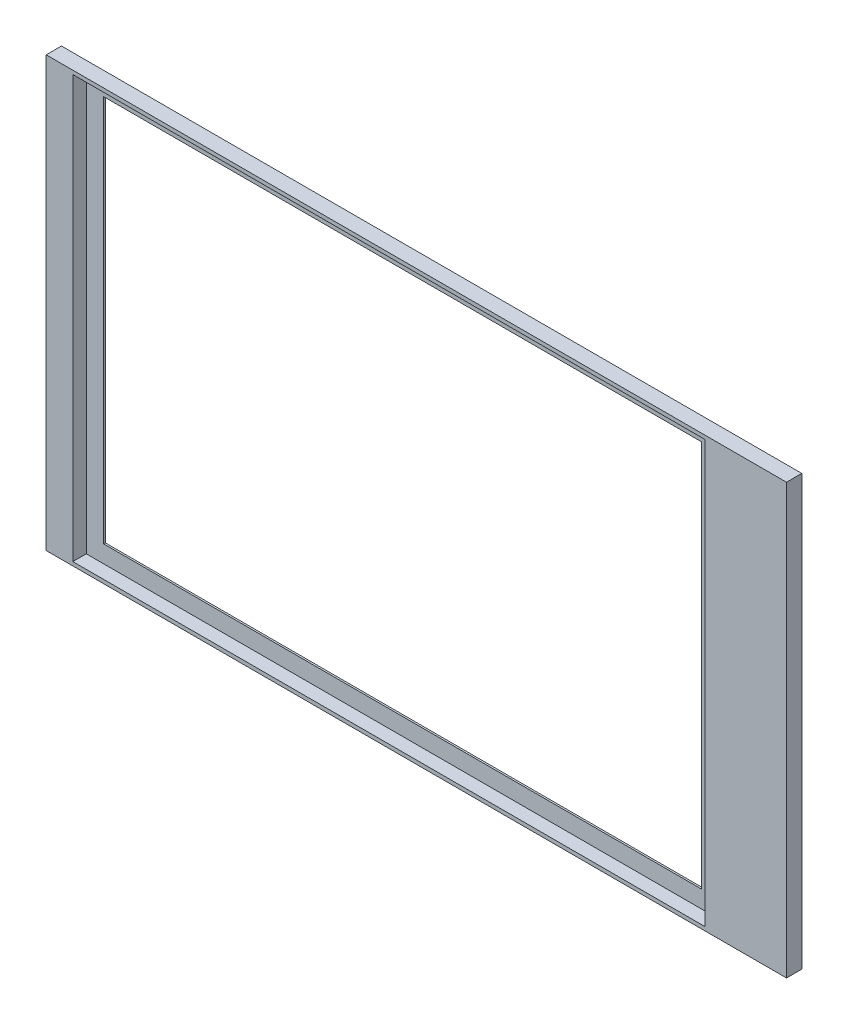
ISO-10303-21;
HEADER;
FILE_DESCRIPTION(('STEP AP214'),'2;1');
FILE_NAME('part.step','',(''),(''),'','','');
FILE_SCHEMA(('AUTOMOTIVE_DESIGN { 1 0 10303 214 1 1 1 1 }'));
ENDSEC;
DATA;
#1=APPLICATION_CONTEXT('core data for automotive mechanical design processes');
#2=APPLICATION_PROTOCOL_DEFINITION('international standard','automotive_design',2000,#1);
#3=PRODUCT_CONTEXT('',#1,'mechanical');
#4=PRODUCT('Part','Part','',(#3));
#5=PRODUCT_RELATED_PRODUCT_CATEGORY('part','',(#4));
#6=PRODUCT_DEFINITION_FORMATION('','',#4);
#7=PRODUCT_DEFINITION_CONTEXT('part definition',#1,'design');
#8=PRODUCT_DEFINITION('design','',#6,#7);
#9=PRODUCT_DEFINITION_SHAPE('','',#8);
#10=(LENGTH_UNIT() NAMED_UNIT(*) SI_UNIT(.MILLI.,.METRE.));
#11=(NAMED_UNIT(*) PLANE_ANGLE_UNIT() SI_UNIT($,.RADIAN.));
#12=(NAMED_UNIT(*) SI_UNIT($,.STERADIAN.) SOLID_ANGLE_UNIT());
#13=UNCERTAINTY_MEASURE_WITH_UNIT(LENGTH_MEASURE(1.E-05),#10,'distance_accuracy_value','');
#14=(GEOMETRIC_REPRESENTATION_CONTEXT(3) GLOBAL_UNCERTAINTY_ASSIGNED_CONTEXT((#13)) GLOBAL_UNIT_ASSIGNED_CONTEXT((#10,
#11,#12)) REPRESENTATION_CONTEXT('',''));
#15=CARTESIAN_POINT('',(0.,0.,0.));
#16=DIRECTION('',(0.,0.,1.));
#17=DIRECTION('',(1.,0.,0.));
#18=AXIS2_PLACEMENT_3D('',#15,#16,#17);
#19=CARTESIAN_POINT('',(0.,723.,23.));
#20=DIRECTION('',(0.,0.,-1.));
#21=DIRECTION('',(-1.,0.,0.));
#22=AXIS2_PLACEMENT_3D('',#19,#20,#21);
#23=PLANE('',#22);
#24=DIRECTION('',(-1.,0.,0.));
#25=VECTOR('',#24,1.);
#26=CARTESIAN_POINT('',(0.,685.,23.));
#27=LINE('',#26,#25);
#28=CARTESIAN_POINT('',(1153.5,685.,23.));
#29=VERTEX_POINT('',#28);
#30=CARTESIAN_POINT('',(38.,685.,23.));
#31=VERTEX_POINT('',#30);
#32=EDGE_CURVE('E138',#29,#31,#27,.T.);
#33=ORIENTED_EDGE('',*,*,#32,.T.);
#34=DIRECTION('',(0.,1.,0.));
#35=VECTOR('',#34,1.);
#36=CARTESIAN_POINT('',(38.,38.,23.));
#37=LINE('',#36,#35);
#38=CARTESIAN_POINT('',(38.,38.,23.));
#39=VERTEX_POINT('',#38);
#40=EDGE_CURVE('E122',#39,#31,#37,.T.);
#41=ORIENTED_EDGE('',*,*,#40,.F.);
#42=DIRECTION('',(-1.,0.,0.));
#43=VECTOR('',#42,1.);
#44=CARTESIAN_POINT('',(1191.5,38.,23.));
#45=LINE('',#44,#43);
#46=CARTESIAN_POINT('',(1153.5,38.,23.));
#47=VERTEX_POINT('',#46);
#48=EDGE_CURVE('E147',#47,#39,#45,.T.);
#49=ORIENTED_EDGE('',*,*,#48,.F.);
#50=DIRECTION('',(0.,-1.,0.));
#51=VECTOR('',#50,1.);
#52=CARTESIAN_POINT('',(1153.5,685.,23.));
#53=LINE('',#52,#51);
#54=EDGE_CURVE('E142',#29,#47,#53,.T.);
#55=ORIENTED_EDGE('',*,*,#54,.F.);
#56=EDGE_LOOP('',(#33,#41,#49,#55));
#57=FACE_BOUND('',#56,.T.);
#58=DIRECTION('',(0.,-1.,0.));
#59=VECTOR('',#58,1.);
#60=CARTESIAN_POINT('',(78.,43.66,23.));
#61=LINE('',#60,#59);
#62=CARTESIAN_POINT('',(78.,679.34,23.));
#63=VERTEX_POINT('',#62);
#64=CARTESIAN_POINT('',(78.,43.66,23.));
#65=VERTEX_POINT('',#64);
#66=EDGE_CURVE('E256',#63,#65,#61,.T.);
#67=ORIENTED_EDGE('',*,*,#66,.F.);
#68=DIRECTION('',(-1.,0.,0.));
#69=VECTOR('',#68,1.);
#70=CARTESIAN_POINT('',(78.,679.34,23.));
#71=LINE('',#70,#69);
#72=CARTESIAN_POINT('',(1031.,679.34,23.));
#73=VERTEX_POINT('',#72);
#74=EDGE_CURVE('E240',#73,#63,#71,.T.);
#75=ORIENTED_EDGE('',*,*,#74,.F.);
#76=DIRECTION('',(0.,1.,0.));
#77=VECTOR('',#76,1.);
#78=CARTESIAN_POINT('',(1031.,43.66,23.));
#79=LINE('',#78,#77);
#80=CARTESIAN_POINT('',(1031.,43.66,23.));
#81=VERTEX_POINT('',#80);
#82=EDGE_CURVE('E245',#81,#73,#79,.T.);
#83=ORIENTED_EDGE('',*,*,#82,.F.);
#84=DIRECTION('',(1.,0.,0.));
#85=VECTOR('',#84,1.);
#86=CARTESIAN_POINT('',(78.,43.66,23.));
#87=LINE('',#86,#85);
#88=EDGE_CURVE('E259',#65,#81,#87,.T.);
#89=ORIENTED_EDGE('',*,*,#88,.F.);
#90=EDGE_LOOP('',(#67,#75,#83,#89));
#91=FACE_BOUND('',#90,.T.);
#92=ADVANCED_FACE('F31',(#57,#91),#23,.F.);
#93=CARTESIAN_POINT('',(0.,723.,0.));
#94=DIRECTION('',(0.,0.,-1.));
#95=DIRECTION('',(-1.,0.,0.));
#96=AXIS2_PLACEMENT_3D('',#93,#94,#95);
#97=PLANE('',#96);
#98=DIRECTION('',(0.,1.,0.));
#99=VECTOR('',#98,1.);
#100=CARTESIAN_POINT('',(38.,38.,0.));
#101=LINE('',#100,#99);
#102=CARTESIAN_POINT('',(38.0000000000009,38.,0.));
#103=VERTEX_POINT('',#102);
#104=CARTESIAN_POINT('',(38.0000000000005,685.,0.));
#105=VERTEX_POINT('',#104);
#106=EDGE_CURVE('E46',#103,#105,#101,.T.);
#107=ORIENTED_EDGE('',*,*,#106,.T.);
#108=DIRECTION('',(-1.,0.,0.));
#109=VECTOR('',#108,1.);
#110=CARTESIAN_POINT('',(1191.5,685.,0.));
#111=LINE('',#110,#109);
#112=CARTESIAN_POINT('',(1153.5,685.,0.));
#113=VERTEX_POINT('',#112);
#114=EDGE_CURVE('E11',#113,#105,#111,.T.);
#115=ORIENTED_EDGE('',*,*,#114,.F.);
#116=DIRECTION('',(0.,1.,0.));
#117=VECTOR('',#116,1.);
#118=CARTESIAN_POINT('',(1153.5,685.,0.));
#119=LINE('',#118,#117);
#120=CARTESIAN_POINT('',(1153.5,38.,0.));
#121=VERTEX_POINT('',#120);
#122=EDGE_CURVE('E143',#121,#113,#119,.T.);
#123=ORIENTED_EDGE('',*,*,#122,.F.);
#124=DIRECTION('',(1.,0.,0.));
#125=VECTOR('',#124,1.);
#126=CARTESIAN_POINT('',(1191.5,38.,0.));
#127=LINE('',#126,#125);
#128=EDGE_CURVE('E39',#103,#121,#127,.T.);
#129=ORIENTED_EDGE('',*,*,#128,.F.);
#130=EDGE_LOOP('',(#107,#115,#123,#129));
#131=FACE_BOUND('',#130,.T.);
#132=DIRECTION('',(0.,-1.,0.));
#133=VECTOR('',#132,1.);
#134=CARTESIAN_POINT('',(104.,653.34,0.));
#135=LINE('',#134,#133);
#136=CARTESIAN_POINT('',(104.,653.34,0.));
#137=VERTEX_POINT('',#136);
#138=CARTESIAN_POINT('',(104.,69.66,0.));
#139=VERTEX_POINT('',#138);
#140=EDGE_CURVE('E216',#137,#139,#135,.T.);
#141=ORIENTED_EDGE('',*,*,#140,.T.);
#142=DIRECTION('',(1.,0.,0.));
#143=VECTOR('',#142,1.);
#144=CARTESIAN_POINT('',(104.,69.66,0.));
#145=LINE('',#144,#143);
#146=CARTESIAN_POINT('',(1005.,69.6599999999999,0.));
#147=VERTEX_POINT('',#146);
#148=EDGE_CURVE('E232',#139,#147,#145,.T.);
#149=ORIENTED_EDGE('',*,*,#148,.T.);
#150=DIRECTION('',(0.,1.,0.));
#151=VECTOR('',#150,1.);
#152=CARTESIAN_POINT('',(1005.,653.34,0.));
#153=LINE('',#152,#151);
#154=CARTESIAN_POINT('',(1005.,653.34,0.));
#155=VERTEX_POINT('',#154);
#156=EDGE_CURVE('E210',#147,#155,#153,.T.);
#157=ORIENTED_EDGE('',*,*,#156,.T.);
#158=DIRECTION('',(-1.,0.,0.));
#159=VECTOR('',#158,1.);
#160=CARTESIAN_POINT('',(104.,653.34,0.));
#161=LINE('',#160,#159);
#162=EDGE_CURVE('E213',#155,#137,#161,.T.);
#163=ORIENTED_EDGE('',*,*,#162,.T.);
#164=EDGE_LOOP('',(#141,#149,#157,#163));
#165=FACE_BOUND('',#164,.T.);
#166=ADVANCED_FACE('F33',(#131,#165),#97,.T.);
#167=CARTESIAN_POINT('',(1191.5,685.,20.34));
#168=DIRECTION('',(0.,-1.,0.));
#169=DIRECTION('',(0.,0.,-1.));
#170=AXIS2_PLACEMENT_3D('',#167,#168,#169);
#171=PLANE('',#170);
#172=ORIENTED_EDGE('',*,*,#114,.T.);
#173=DIRECTION('',(0.,0.,1.));
#174=VECTOR('',#173,1.);
#175=CARTESIAN_POINT('',(38.,685.,-0.001000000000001));
#176=LINE('',#175,#174);
#177=EDGE_CURVE('E118',#105,#31,#176,.T.);
#178=ORIENTED_EDGE('',*,*,#177,.T.);
#179=ORIENTED_EDGE('',*,*,#32,.F.);
#180=DIRECTION('',(0.,0.,1.));
#181=VECTOR('',#180,1.);
#182=CARTESIAN_POINT('',(1153.5,685.,0.));
#183=LINE('',#182,#181);
#184=EDGE_CURVE('E137',#113,#29,#183,.T.);
#185=ORIENTED_EDGE('',*,*,#184,.F.);
#186=EDGE_LOOP('',(#172,#178,#179,#185));
#187=FACE_BOUND('',#186,.T.);
#188=ADVANCED_FACE('F136',(#187),#171,.F.);
#189=CARTESIAN_POINT('',(1191.5,38.,20.34));
#190=DIRECTION('',(0.,1.,0.));
#191=DIRECTION('',(0.,0.,1.));
#192=AXIS2_PLACEMENT_3D('',#189,#190,#191);
#193=PLANE('',#192);
#194=ORIENTED_EDGE('',*,*,#48,.T.);
#195=DIRECTION('',(0.,0.,1.));
#196=VECTOR('',#195,1.);
#197=CARTESIAN_POINT('',(38.,38.,-0.001000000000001));
#198=LINE('',#197,#196);
#199=EDGE_CURVE('E127',#103,#39,#198,.T.);
#200=ORIENTED_EDGE('',*,*,#199,.F.);
#201=ORIENTED_EDGE('',*,*,#128,.T.);
#202=DIRECTION('',(0.,0.,-1.));
#203=VECTOR('',#202,1.);
#204=CARTESIAN_POINT('',(1153.5,38.,0.));
#205=LINE('',#204,#203);
#206=EDGE_CURVE('E145',#47,#121,#205,.T.);
#207=ORIENTED_EDGE('',*,*,#206,.F.);
#208=EDGE_LOOP('',(#194,#200,#201,#207));
#209=FACE_BOUND('',#208,.T.);
#210=ADVANCED_FACE('F273',(#209),#193,.F.);
#211=CARTESIAN_POINT('',(78.,679.34,2.66));
#212=DIRECTION('',(0.,1.,0.));
#213=DIRECTION('',(0.,0.,1.));
#214=AXIS2_PLACEMENT_3D('',#211,#212,#213);
#215=PLANE('',#214);
#216=ORIENTED_EDGE('',*,*,#74,.T.);
#217=DIRECTION('',(0.,0.,1.));
#218=VECTOR('',#217,1.);
#219=CARTESIAN_POINT('',(78.,679.34,2.66));
#220=LINE('',#219,#218);
#221=CARTESIAN_POINT('',(78.,679.34,2.66));
#222=VERTEX_POINT('',#221);
#223=EDGE_CURVE('E254',#222,#63,#220,.T.);
#224=ORIENTED_EDGE('',*,*,#223,.F.);
#225=DIRECTION('',(-1.,0.,0.));
#226=VECTOR('',#225,1.);
#227=CARTESIAN_POINT('',(78.,679.34,2.66));
#228=LINE('',#227,#226);
#229=CARTESIAN_POINT('',(1031.,679.34,2.66));
#230=VERTEX_POINT('',#229);
#231=EDGE_CURVE('E241',#230,#222,#228,.T.);
#232=ORIENTED_EDGE('',*,*,#231,.F.);
#233=DIRECTION('',(0.,0.,1.));
#234=VECTOR('',#233,1.);
#235=CARTESIAN_POINT('',(1031.,679.34,2.66));
#236=LINE('',#235,#234);
#237=EDGE_CURVE('E264',#230,#73,#236,.T.);
#238=ORIENTED_EDGE('',*,*,#237,.T.);
#239=EDGE_LOOP('',(#216,#224,#232,#238));
#240=FACE_BOUND('',#239,.T.);
#241=ADVANCED_FACE('F366',(#240),#215,.F.);
#242=CARTESIAN_POINT('',(1031.,43.66,2.66));
#243=DIRECTION('',(1.,0.,0.));
#244=DIRECTION('',(0.,0.,-1.));
#245=AXIS2_PLACEMENT_3D('',#242,#243,#244);
#246=PLANE('',#245);
#247=ORIENTED_EDGE('',*,*,#82,.T.);
#248=ORIENTED_EDGE('',*,*,#237,.F.);
#249=DIRECTION('',(0.,1.,0.));
#250=VECTOR('',#249,1.);
#251=CARTESIAN_POINT('',(1031.,43.66,2.66));
#252=LINE('',#251,#250);
#253=CARTESIAN_POINT('',(1031.,43.66,2.66));
#254=VERTEX_POINT('',#253);
#255=EDGE_CURVE('E251',#254,#230,#252,.T.);
#256=ORIENTED_EDGE('',*,*,#255,.F.);
#257=DIRECTION('',(0.,0.,1.));
#258=VECTOR('',#257,1.);
#259=CARTESIAN_POINT('',(1031.,43.66,2.66));
#260=LINE('',#259,#258);
#261=EDGE_CURVE('E266',#254,#81,#260,.T.);
#262=ORIENTED_EDGE('',*,*,#261,.T.);
#263=EDGE_LOOP('',(#247,#248,#256,#262));
#264=FACE_BOUND('',#263,.T.);
#265=ADVANCED_FACE('F369',(#264),#246,.F.);
#266=CARTESIAN_POINT('',(78.,43.66,2.66));
#267=DIRECTION('',(0.,-1.,0.));
#268=DIRECTION('',(1.,0.,0.));
#269=AXIS2_PLACEMENT_3D('',#266,#267,#268);
#270=PLANE('',#269);
#271=ORIENTED_EDGE('',*,*,#88,.T.);
#272=ORIENTED_EDGE('',*,*,#261,.F.);
#273=DIRECTION('',(1.,0.,0.));
#274=VECTOR('',#273,1.);
#275=CARTESIAN_POINT('',(78.,43.66,2.66));
#276=LINE('',#275,#274);
#277=CARTESIAN_POINT('',(78.,43.66,2.66));
#278=VERTEX_POINT('',#277);
#279=EDGE_CURVE('E248',#278,#254,#276,.T.);
#280=ORIENTED_EDGE('',*,*,#279,.F.);
#281=DIRECTION('',(0.,0.,1.));
#282=VECTOR('',#281,1.);
#283=CARTESIAN_POINT('',(78.,43.66,2.66));
#284=LINE('',#283,#282);
#285=EDGE_CURVE('E268',#278,#65,#284,.T.);
#286=ORIENTED_EDGE('',*,*,#285,.T.);
#287=EDGE_LOOP('',(#271,#272,#280,#286));
#288=FACE_BOUND('',#287,.T.);
#289=ADVANCED_FACE('F375',(#288),#270,.F.);
#290=CARTESIAN_POINT('',(78.,43.66,2.66));
#291=DIRECTION('',(-1.,0.,0.));
#292=DIRECTION('',(0.,-1.,0.));
#293=AXIS2_PLACEMENT_3D('',#290,#291,#292);
#294=PLANE('',#293);
#295=ORIENTED_EDGE('',*,*,#66,.T.);
#296=ORIENTED_EDGE('',*,*,#285,.F.);
#297=DIRECTION('',(0.,-1.,0.));
#298=VECTOR('',#297,1.);
#299=CARTESIAN_POINT('',(78.,43.66,2.66));
#300=LINE('',#299,#298);
#301=EDGE_CURVE('E244',#222,#278,#300,.T.);
#302=ORIENTED_EDGE('',*,*,#301,.F.);
#303=ORIENTED_EDGE('',*,*,#223,.T.);
#304=EDGE_LOOP('',(#295,#296,#302,#303));
#305=FACE_BOUND('',#304,.T.);
#306=ADVANCED_FACE('F371',(#305),#294,.F.);
#307=CARTESIAN_POINT('',(1031.,679.34,2.66));
#308=DIRECTION('',(0.,0.,1.));
#309=DIRECTION('',(1.,0.,0.));
#310=AXIS2_PLACEMENT_3D('',#307,#308,#309);
#311=PLANE('',#310);
#312=DIRECTION('',(0.,-1.,0.));
#313=VECTOR('',#312,1.);
#314=CARTESIAN_POINT('',(104.,653.34,2.66));
#315=LINE('',#314,#313);
#316=CARTESIAN_POINT('',(104.,653.34,2.66));
#317=VERTEX_POINT('',#316);
#318=CARTESIAN_POINT('',(104.,69.6599999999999,2.66));
#319=VERTEX_POINT('',#318);
#320=EDGE_CURVE('E219',#317,#319,#315,.T.);
#321=ORIENTED_EDGE('',*,*,#320,.F.);
#322=DIRECTION('',(-1.,0.,0.));
#323=VECTOR('',#322,1.);
#324=CARTESIAN_POINT('',(104.,653.34,2.66));
#325=LINE('',#324,#323);
#326=CARTESIAN_POINT('',(1005.,653.34,2.66));
#327=VERTEX_POINT('',#326);
#328=EDGE_CURVE('E226',#327,#317,#325,.T.);
#329=ORIENTED_EDGE('',*,*,#328,.F.);
#330=DIRECTION('',(0.,1.,0.));
#331=VECTOR('',#330,1.);
#332=CARTESIAN_POINT('',(1005.,653.34,2.66));
#333=LINE('',#332,#331);
#334=CARTESIAN_POINT('',(1005.,69.66,2.66));
#335=VERTEX_POINT('',#334);
#336=EDGE_CURVE('E223',#335,#327,#333,.T.);
#337=ORIENTED_EDGE('',*,*,#336,.F.);
#338=DIRECTION('',(1.,0.,0.));
#339=VECTOR('',#338,1.);
#340=CARTESIAN_POINT('',(104.,69.66,2.66));
#341=LINE('',#340,#339);
#342=EDGE_CURVE('E221',#319,#335,#341,.T.);
#343=ORIENTED_EDGE('',*,*,#342,.F.);
#344=EDGE_LOOP('',(#321,#329,#337,#343));
#345=FACE_BOUND('',#344,.T.);
#346=ORIENTED_EDGE('',*,*,#231,.T.);
#347=ORIENTED_EDGE('',*,*,#301,.T.);
#348=ORIENTED_EDGE('',*,*,#279,.T.);
#349=ORIENTED_EDGE('',*,*,#255,.T.);
#350=EDGE_LOOP('',(#346,#347,#348,#349));
#351=FACE_BOUND('',#350,.T.);
#352=ADVANCED_FACE('F374',(#345,#351),#311,.T.);
#353=CARTESIAN_POINT('',(104.,653.34,-0.00100000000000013));
#354=DIRECTION('',(-1.,0.,0.));
#355=DIRECTION('',(0.,0.,1.));
#356=AXIS2_PLACEMENT_3D('',#353,#354,#355);
#357=PLANE('',#356);
#358=DIRECTION('',(0.,0.,1.));
#359=VECTOR('',#358,1.);
#360=CARTESIAN_POINT('',(104.,653.34,-0.00100000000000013));
#361=LINE('',#360,#359);
#362=EDGE_CURVE('E230',#137,#317,#361,.T.);
#363=ORIENTED_EDGE('',*,*,#362,.T.);
#364=ORIENTED_EDGE('',*,*,#320,.T.);
#365=DIRECTION('',(0.,0.,1.));
#366=VECTOR('',#365,1.);
#367=CARTESIAN_POINT('',(104.,69.66,-0.00100000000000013));
#368=LINE('',#367,#366);
#369=EDGE_CURVE('E229',#139,#319,#368,.T.);
#370=ORIENTED_EDGE('',*,*,#369,.F.);
#371=ORIENTED_EDGE('',*,*,#140,.F.);
#372=EDGE_LOOP('',(#363,#364,#370,#371));
#373=FACE_BOUND('',#372,.T.);
#374=ADVANCED_FACE('F385',(#373),#357,.F.);
#375=CARTESIAN_POINT('',(104.,653.34,-0.00100000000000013));
#376=DIRECTION('',(0.,1.,0.));
#377=DIRECTION('',(0.,0.,1.));
#378=AXIS2_PLACEMENT_3D('',#375,#376,#377);
#379=PLANE('',#378);
#380=DIRECTION('',(0.,0.,1.));
#381=VECTOR('',#380,1.);
#382=CARTESIAN_POINT('',(1005.,653.34,-0.00100000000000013));
#383=LINE('',#382,#381);
#384=EDGE_CURVE('E233',#155,#327,#383,.T.);
#385=ORIENTED_EDGE('',*,*,#384,.T.);
#386=ORIENTED_EDGE('',*,*,#328,.T.);
#387=ORIENTED_EDGE('',*,*,#362,.F.);
#388=ORIENTED_EDGE('',*,*,#162,.F.);
#389=EDGE_LOOP('',(#385,#386,#387,#388));
#390=FACE_BOUND('',#389,.T.);
#391=ADVANCED_FACE('F389',(#390),#379,.F.);
#392=CARTESIAN_POINT('',(1005.,653.34,-0.00100000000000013));
#393=DIRECTION('',(1.,0.,0.));
#394=DIRECTION('',(0.,0.,-1.));
#395=AXIS2_PLACEMENT_3D('',#392,#393,#394);
#396=PLANE('',#395);
#397=DIRECTION('',(0.,0.,1.));
#398=VECTOR('',#397,1.);
#399=CARTESIAN_POINT('',(1005.,69.66,-0.00100000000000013));
#400=LINE('',#399,#398);
#401=EDGE_CURVE('E54',#147,#335,#400,.T.);
#402=ORIENTED_EDGE('',*,*,#401,.T.);
#403=ORIENTED_EDGE('',*,*,#336,.T.);
#404=ORIENTED_EDGE('',*,*,#384,.F.);
#405=ORIENTED_EDGE('',*,*,#156,.F.);
#406=EDGE_LOOP('',(#402,#403,#404,#405));
#407=FACE_BOUND('',#406,.T.);
#408=ADVANCED_FACE('F394',(#407),#396,.F.);
#409=CARTESIAN_POINT('',(104.,69.66,-0.00100000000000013));
#410=DIRECTION('',(0.,-1.,0.));
#411=DIRECTION('',(0.,0.,-1.));
#412=AXIS2_PLACEMENT_3D('',#409,#410,#411);
#413=PLANE('',#412);
#414=ORIENTED_EDGE('',*,*,#369,.T.);
#415=ORIENTED_EDGE('',*,*,#342,.T.);
#416=ORIENTED_EDGE('',*,*,#401,.F.);
#417=ORIENTED_EDGE('',*,*,#148,.F.);
#418=EDGE_LOOP('',(#414,#415,#416,#417));
#419=FACE_BOUND('',#418,.T.);
#420=ADVANCED_FACE('F391',(#419),#413,.F.);
#421=CARTESIAN_POINT('',(1153.5,38.,0.));
#422=DIRECTION('',(-1.,0.,0.));
#423=DIRECTION('',(0.,0.,1.));
#424=AXIS2_PLACEMENT_3D('',#421,#422,#423);
#425=PLANE('',#424);
#426=ORIENTED_EDGE('',*,*,#122,.T.);
#427=ORIENTED_EDGE('',*,*,#184,.T.);
#428=ORIENTED_EDGE('',*,*,#54,.T.);
#429=ORIENTED_EDGE('',*,*,#206,.T.);
#430=EDGE_LOOP('',(#426,#427,#428,#429));
#431=FACE_BOUND('',#430,.T.);
#432=ADVANCED_FACE('F275',(#431),#425,.F.);
#433=CARTESIAN_POINT('',(38.,38.,-0.001000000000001));
#434=DIRECTION('',(1.,0.,0.));
#435=DIRECTION('',(0.,0.,-1.));
#436=AXIS2_PLACEMENT_3D('',#433,#434,#435);
#437=PLANE('',#436);
#438=CARTESIAN_POINT('',(38.,606.25,12.749999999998));
#439=DIRECTION('',(1.,0.,0.));
#440=DIRECTION('',(0.,0.,-1.));
#441=AXIS2_PLACEMENT_3D('',#438,#439,#440);
#442=CIRCLE('',#441,4.76249999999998);
#443=CARTESIAN_POINT('',(38.,606.25,7.98749999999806));
#444=VERTEX_POINT('',#443);
#445=EDGE_CURVE('E283',#444,#444,#442,.T.);
#446=ORIENTED_EDGE('',*,*,#445,.T.);
#447=EDGE_LOOP('',(#446));
#448=FACE_BOUND('',#447,.T.);
#449=CARTESIAN_POINT('',(38.,536.25,12.7499999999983));
#450=DIRECTION('',(1.,0.,0.));
#451=DIRECTION('',(0.,0.,-1.));
#452=AXIS2_PLACEMENT_3D('',#449,#450,#451);
#453=CIRCLE('',#452,4.76250000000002);
#454=CARTESIAN_POINT('',(38.,536.25,7.98749999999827));
#455=VERTEX_POINT('',#454);
#456=EDGE_CURVE('E289',#455,#455,#453,.T.);
#457=ORIENTED_EDGE('',*,*,#456,.T.);
#458=EDGE_LOOP('',(#457));
#459=FACE_BOUND('',#458,.T.);
#460=CARTESIAN_POINT('',(38.,466.25,12.7499999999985));
#461=DIRECTION('',(1.,0.,0.));
#462=DIRECTION('',(0.,0.,-1.));
#463=AXIS2_PLACEMENT_3D('',#460,#461,#462);
#464=CIRCLE('',#463,4.7625);
#465=CARTESIAN_POINT('',(38.,466.25,7.98749999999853));
#466=VERTEX_POINT('',#465);
#467=EDGE_CURVE('E295',#466,#466,#464,.T.);
#468=ORIENTED_EDGE('',*,*,#467,.T.);
#469=EDGE_LOOP('',(#468));
#470=FACE_BOUND('',#469,.T.);
#471=CARTESIAN_POINT('',(38.,396.25,12.7499999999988));
#472=DIRECTION('',(1.,0.,0.));
#473=DIRECTION('',(0.,0.,-1.));
#474=AXIS2_PLACEMENT_3D('',#471,#472,#473);
#475=CIRCLE('',#474,4.7625);
#476=CARTESIAN_POINT('',(38.,396.25,7.98749999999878));
#477=VERTEX_POINT('',#476);
#478=EDGE_CURVE('E301',#477,#477,#475,.T.);
#479=ORIENTED_EDGE('',*,*,#478,.T.);
#480=EDGE_LOOP('',(#479));
#481=FACE_BOUND('',#480,.T.);
#482=CARTESIAN_POINT('',(38.,326.25,12.749999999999));
#483=DIRECTION('',(1.,0.,0.));
#484=DIRECTION('',(0.,0.,-1.));
#485=AXIS2_PLACEMENT_3D('',#482,#483,#484);
#486=CIRCLE('',#485,4.7625);
#487=CARTESIAN_POINT('',(38.,326.25,7.98749999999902));
#488=VERTEX_POINT('',#487);
#489=EDGE_CURVE('E307',#488,#488,#486,.T.);
#490=ORIENTED_EDGE('',*,*,#489,.T.);
#491=EDGE_LOOP('',(#490));
#492=FACE_BOUND('',#491,.T.);
#493=CARTESIAN_POINT('',(38.,256.25,12.7499999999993));
#494=DIRECTION('',(1.,0.,0.));
#495=DIRECTION('',(0.,0.,-1.));
#496=AXIS2_PLACEMENT_3D('',#493,#494,#495);
#497=CIRCLE('',#496,4.7625);
#498=CARTESIAN_POINT('',(38.,256.25,7.98749999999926));
#499=VERTEX_POINT('',#498);
#500=EDGE_CURVE('E313',#499,#499,#497,.T.);
#501=ORIENTED_EDGE('',*,*,#500,.T.);
#502=EDGE_LOOP('',(#501));
#503=FACE_BOUND('',#502,.T.);
#504=CARTESIAN_POINT('',(38.,186.25,12.7499999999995));
#505=DIRECTION('',(1.,0.,0.));
#506=DIRECTION('',(0.,0.,-1.));
#507=AXIS2_PLACEMENT_3D('',#504,#505,#506);
#508=CIRCLE('',#507,4.7625);
#509=CARTESIAN_POINT('',(38.,186.25,7.98749999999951));
#510=VERTEX_POINT('',#509);
#511=EDGE_CURVE('E319',#510,#510,#508,.T.);
#512=ORIENTED_EDGE('',*,*,#511,.T.);
#513=EDGE_LOOP('',(#512));
#514=FACE_BOUND('',#513,.T.);
#515=CARTESIAN_POINT('',(38.,116.25,12.7499999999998));
#516=DIRECTION('',(1.,0.,0.));
#517=DIRECTION('',(0.,0.,-1.));
#518=AXIS2_PLACEMENT_3D('',#515,#516,#517);
#519=CIRCLE('',#518,4.76250000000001);
#520=CARTESIAN_POINT('',(38.,116.25,7.98749999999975));
#521=VERTEX_POINT('',#520);
#522=EDGE_CURVE('E325',#521,#521,#519,.T.);
#523=ORIENTED_EDGE('',*,*,#522,.T.);
#524=EDGE_LOOP('',(#523));
#525=FACE_BOUND('',#524,.T.);
#526=CARTESIAN_POINT('',(38.,46.25,12.75));
#527=DIRECTION('',(1.,0.,0.));
#528=DIRECTION('',(0.,0.,-1.));
#529=AXIS2_PLACEMENT_3D('',#526,#527,#528);
#530=CIRCLE('',#529,4.7625);
#531=CARTESIAN_POINT('',(38.,46.25,7.9875));
#532=VERTEX_POINT('',#531);
#533=EDGE_CURVE('E331',#532,#532,#530,.T.);
#534=ORIENTED_EDGE('',*,*,#533,.T.);
#535=EDGE_LOOP('',(#534));
#536=FACE_BOUND('',#535,.T.);
#537=ORIENTED_EDGE('',*,*,#199,.T.);
#538=ORIENTED_EDGE('',*,*,#40,.T.);
#539=ORIENTED_EDGE('',*,*,#177,.F.);
#540=ORIENTED_EDGE('',*,*,#106,.F.);
#541=EDGE_LOOP('',(#537,#538,#539,#540));
#542=FACE_BOUND('',#541,.T.);
#543=CARTESIAN_POINT('',(38.,676.25,12.7499999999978));
#544=DIRECTION('',(1.,0.,0.));
#545=DIRECTION('',(0.,0.,-1.));
#546=AXIS2_PLACEMENT_3D('',#543,#544,#545);
#547=CIRCLE('',#546,4.76249999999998);
#548=CARTESIAN_POINT('',(38.,676.25,7.98749999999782));
#549=VERTEX_POINT('',#548);
#550=EDGE_CURVE('E126',#549,#549,#547,.T.);
#551=ORIENTED_EDGE('',*,*,#550,.T.);
#552=EDGE_LOOP('',(#551));
#553=FACE_BOUND('',#552,.T.);
#554=CARTESIAN_POINT('',(38.,81.25,12.7499999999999));
#555=DIRECTION('',(1.,0.,0.));
#556=DIRECTION('',(0.,0.,-1.));
#557=AXIS2_PLACEMENT_3D('',#554,#555,#556);
#558=CIRCLE('',#557,4.7625);
#559=CARTESIAN_POINT('',(38.,81.25,7.98749999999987));
#560=VERTEX_POINT('',#559);
#561=EDGE_CURVE('E328',#560,#560,#558,.T.);
#562=ORIENTED_EDGE('',*,*,#561,.T.);
#563=EDGE_LOOP('',(#562));
#564=FACE_BOUND('',#563,.T.);
#565=CARTESIAN_POINT('',(38.,151.25,12.7499999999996));
#566=DIRECTION('',(1.,0.,0.));
#567=DIRECTION('',(0.,0.,-1.));
#568=AXIS2_PLACEMENT_3D('',#565,#566,#567);
#569=CIRCLE('',#568,4.76250000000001);
#570=CARTESIAN_POINT('',(38.,151.25,7.98749999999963));
#571=VERTEX_POINT('',#570);
#572=EDGE_CURVE('E322',#571,#571,#569,.T.);
#573=ORIENTED_EDGE('',*,*,#572,.T.);
#574=EDGE_LOOP('',(#573));
#575=FACE_BOUND('',#574,.T.);
#576=CARTESIAN_POINT('',(38.,221.25,12.7499999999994));
#577=DIRECTION('',(1.,0.,0.));
#578=DIRECTION('',(0.,0.,-1.));
#579=AXIS2_PLACEMENT_3D('',#576,#577,#578);
#580=CIRCLE('',#579,4.76250000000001);
#581=CARTESIAN_POINT('',(38.,221.25,7.98749999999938));
#582=VERTEX_POINT('',#581);
#583=EDGE_CURVE('E316',#582,#582,#580,.T.);
#584=ORIENTED_EDGE('',*,*,#583,.T.);
#585=EDGE_LOOP('',(#584));
#586=FACE_BOUND('',#585,.T.);
#587=CARTESIAN_POINT('',(38.,291.25,12.7499999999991));
#588=DIRECTION('',(1.,0.,0.));
#589=DIRECTION('',(0.,0.,-1.));
#590=AXIS2_PLACEMENT_3D('',#587,#588,#589);
#591=CIRCLE('',#590,4.7625);
#592=CARTESIAN_POINT('',(38.,291.25,7.98749999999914));
#593=VERTEX_POINT('',#592);
#594=EDGE_CURVE('E310',#593,#593,#591,.T.);
#595=ORIENTED_EDGE('',*,*,#594,.T.);
#596=EDGE_LOOP('',(#595));
#597=FACE_BOUND('',#596,.T.);
#598=CARTESIAN_POINT('',(38.,361.25,12.7499999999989));
#599=DIRECTION('',(1.,0.,0.));
#600=DIRECTION('',(0.,0.,-1.));
#601=AXIS2_PLACEMENT_3D('',#598,#599,#600);
#602=CIRCLE('',#601,4.7625);
#603=CARTESIAN_POINT('',(38.,361.25,7.9874999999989));
#604=VERTEX_POINT('',#603);
#605=EDGE_CURVE('E304',#604,#604,#602,.T.);
#606=ORIENTED_EDGE('',*,*,#605,.T.);
#607=EDGE_LOOP('',(#606));
#608=FACE_BOUND('',#607,.T.);
#609=CARTESIAN_POINT('',(38.,431.25,12.7499999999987));
#610=DIRECTION('',(1.,0.,0.));
#611=DIRECTION('',(0.,0.,-1.));
#612=AXIS2_PLACEMENT_3D('',#609,#610,#611);
#613=CIRCLE('',#612,4.7625);
#614=CARTESIAN_POINT('',(38.,431.25,7.98749999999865));
#615=VERTEX_POINT('',#614);
#616=EDGE_CURVE('E298',#615,#615,#613,.T.);
#617=ORIENTED_EDGE('',*,*,#616,.T.);
#618=EDGE_LOOP('',(#617));
#619=FACE_BOUND('',#618,.T.);
#620=CARTESIAN_POINT('',(38.,501.25,12.7499999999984));
#621=DIRECTION('',(1.,0.,0.));
#622=DIRECTION('',(0.,0.,-1.));
#623=AXIS2_PLACEMENT_3D('',#620,#621,#622);
#624=CIRCLE('',#623,4.76249999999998);
#625=CARTESIAN_POINT('',(38.,501.25,7.98749999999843));
#626=VERTEX_POINT('',#625);
#627=EDGE_CURVE('E292',#626,#626,#624,.T.);
#628=ORIENTED_EDGE('',*,*,#627,.T.);
#629=EDGE_LOOP('',(#628));
#630=FACE_BOUND('',#629,.T.);
#631=CARTESIAN_POINT('',(38.,571.25,12.7499999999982));
#632=DIRECTION('',(1.,0.,0.));
#633=DIRECTION('',(0.,0.,-1.));
#634=AXIS2_PLACEMENT_3D('',#631,#632,#633);
#635=CIRCLE('',#634,4.76249999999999);
#636=CARTESIAN_POINT('',(38.,571.25,7.98749999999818));
#637=VERTEX_POINT('',#636);
#638=EDGE_CURVE('E286',#637,#637,#635,.T.);
#639=ORIENTED_EDGE('',*,*,#638,.T.);
#640=EDGE_LOOP('',(#639));
#641=FACE_BOUND('',#640,.T.);
#642=CARTESIAN_POINT('',(38.,641.25,12.7499999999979));
#643=DIRECTION('',(1.,0.,0.));
#644=DIRECTION('',(0.,0.,-1.));
#645=AXIS2_PLACEMENT_3D('',#642,#643,#644);
#646=CIRCLE('',#645,4.76249999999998);
#647=CARTESIAN_POINT('',(38.,641.25,7.98749999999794));
#648=VERTEX_POINT('',#647);
#649=EDGE_CURVE('E278',#648,#648,#646,.T.);
#650=ORIENTED_EDGE('',*,*,#649,.T.);
#651=EDGE_LOOP('',(#650));
#652=FACE_BOUND('',#651,.T.);
#653=ADVANCED_FACE('F119',(#448,#459,#470,#481,#492,#503,#514,#525,#536,#542,#553,#564,#575,
#586,#597,#608,#619,#630,#641,#652),#437,.F.);
#654=CARTESIAN_POINT('',(65.,46.25,12.75));
#655=DIRECTION('',(-1.,0.,0.));
#656=DIRECTION('',(0.,0.,1.));
#657=AXIS2_PLACEMENT_3D('',#654,#655,#656);
#658=PLANE('',#657);
#659=CARTESIAN_POINT('',(65.,46.25,12.75));
#660=DIRECTION('',(-1.,0.,0.));
#661=DIRECTION('',(0.,0.,1.));
#662=AXIS2_PLACEMENT_3D('',#659,#660,#661);
#663=CIRCLE('',#662,4.7625);
#664=CARTESIAN_POINT('',(65.,46.25,17.5125));
#665=VERTEX_POINT('',#664);
#666=EDGE_CURVE('E207',#665,#665,#663,.T.);
#667=ORIENTED_EDGE('',*,*,#666,.T.);
#668=EDGE_LOOP('',(#667));
#669=FACE_BOUND('',#668,.T.);
#670=ADVANCED_FACE('F405',(#669),#658,.T.);
#671=CARTESIAN_POINT('',(65.,46.25,12.75));
#672=DIRECTION('',(-1.,0.,0.));
#673=DIRECTION('',(0.,0.,1.));
#674=AXIS2_PLACEMENT_3D('',#671,#672,#673);
#675=CYLINDRICAL_SURFACE('',#674,4.7625);
#676=ORIENTED_EDGE('',*,*,#533,.F.);
#677=EDGE_LOOP('',(#676));
#678=FACE_BOUND('',#677,.T.);
#679=ORIENTED_EDGE('',*,*,#666,.F.);
#680=EDGE_LOOP('',(#679));
#681=FACE_BOUND('',#680,.T.);
#682=ADVANCED_FACE('F401',(#678,#681),#675,.F.);
#683=CARTESIAN_POINT('',(65.,81.25,12.7499999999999));
#684=DIRECTION('',(-1.,0.,0.));
#685=DIRECTION('',(0.,0.,1.));
#686=AXIS2_PLACEMENT_3D('',#683,#684,#685);
#687=PLANE('',#686);
#688=CARTESIAN_POINT('',(65.,81.25,12.7499999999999));
#689=DIRECTION('',(-1.,0.,0.));
#690=DIRECTION('',(0.,0.,1.));
#691=AXIS2_PLACEMENT_3D('',#688,#689,#690);
#692=CIRCLE('',#691,4.7625);
#693=CARTESIAN_POINT('',(65.,81.25,17.5124999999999));
#694=VERTEX_POINT('',#693);
#695=EDGE_CURVE('E204',#694,#694,#692,.T.);
#696=ORIENTED_EDGE('',*,*,#695,.T.);
#697=EDGE_LOOP('',(#696));
#698=FACE_BOUND('',#697,.T.);
#699=ADVANCED_FACE('F404',(#698),#687,.T.);
#700=CARTESIAN_POINT('',(65.,81.25,12.7499999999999));
#701=DIRECTION('',(-1.,0.,0.));
#702=DIRECTION('',(0.,0.,1.));
#703=AXIS2_PLACEMENT_3D('',#700,#701,#702);
#704=CYLINDRICAL_SURFACE('',#703,4.7625);
#705=ORIENTED_EDGE('',*,*,#561,.F.);
#706=EDGE_LOOP('',(#705));
#707=FACE_BOUND('',#706,.T.);
#708=ORIENTED_EDGE('',*,*,#695,.F.);
#709=EDGE_LOOP('',(#708));
#710=FACE_BOUND('',#709,.T.);
#711=ADVANCED_FACE('F410',(#707,#710),#704,.F.);
#712=CARTESIAN_POINT('',(65.,116.25,12.7499999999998));
#713=DIRECTION('',(-1.,0.,0.));
#714=DIRECTION('',(0.,0.,1.));
#715=AXIS2_PLACEMENT_3D('',#712,#713,#714);
#716=PLANE('',#715);
#717=CARTESIAN_POINT('',(65.,116.25,12.7499999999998));
#718=DIRECTION('',(-1.,0.,0.));
#719=DIRECTION('',(0.,0.,1.));
#720=AXIS2_PLACEMENT_3D('',#717,#718,#719);
#721=CIRCLE('',#720,4.76250000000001);
#722=CARTESIAN_POINT('',(65.,116.25,17.5124999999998));
#723=VERTEX_POINT('',#722);
#724=EDGE_CURVE('E201',#723,#723,#721,.T.);
#725=ORIENTED_EDGE('',*,*,#724,.T.);
#726=EDGE_LOOP('',(#725));
#727=FACE_BOUND('',#726,.T.);
#728=ADVANCED_FACE('F413',(#727),#716,.T.);
#729=CARTESIAN_POINT('',(65.,116.25,12.7499999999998));
#730=DIRECTION('',(-1.,0.,0.));
#731=DIRECTION('',(0.,0.,1.));
#732=AXIS2_PLACEMENT_3D('',#729,#730,#731);
#733=CYLINDRICAL_SURFACE('',#732,4.76250000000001);
#734=ORIENTED_EDGE('',*,*,#522,.F.);
#735=EDGE_LOOP('',(#734));
#736=FACE_BOUND('',#735,.T.);
#737=ORIENTED_EDGE('',*,*,#724,.F.);
#738=EDGE_LOOP('',(#737));
#739=FACE_BOUND('',#738,.T.);
#740=ADVANCED_FACE('F418',(#736,#739),#733,.F.);
#741=CARTESIAN_POINT('',(65.,151.25,12.7499999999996));
#742=DIRECTION('',(-1.,0.,0.));
#743=DIRECTION('',(0.,0.,1.));
#744=AXIS2_PLACEMENT_3D('',#741,#742,#743);
#745=PLANE('',#744);
#746=CARTESIAN_POINT('',(65.,151.25,12.7499999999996));
#747=DIRECTION('',(-1.,0.,0.));
#748=DIRECTION('',(0.,0.,1.));
#749=AXIS2_PLACEMENT_3D('',#746,#747,#748);
#750=CIRCLE('',#749,4.76250000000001);
#751=CARTESIAN_POINT('',(65.,151.25,17.5124999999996));
#752=VERTEX_POINT('',#751);
#753=EDGE_CURVE('E198',#752,#752,#750,.T.);
#754=ORIENTED_EDGE('',*,*,#753,.T.);
#755=EDGE_LOOP('',(#754));
#756=FACE_BOUND('',#755,.T.);
#757=ADVANCED_FACE('F421',(#756),#745,.T.);
#758=CARTESIAN_POINT('',(65.,151.25,12.7499999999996));
#759=DIRECTION('',(-1.,0.,0.));
#760=DIRECTION('',(0.,0.,1.));
#761=AXIS2_PLACEMENT_3D('',#758,#759,#760);
#762=CYLINDRICAL_SURFACE('',#761,4.76250000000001);
#763=ORIENTED_EDGE('',*,*,#572,.F.);
#764=EDGE_LOOP('',(#763));
#765=FACE_BOUND('',#764,.T.);
#766=ORIENTED_EDGE('',*,*,#753,.F.);
#767=EDGE_LOOP('',(#766));
#768=FACE_BOUND('',#767,.T.);
#769=ADVANCED_FACE('F426',(#765,#768),#762,.F.);
#770=CARTESIAN_POINT('',(65.,186.25,12.7499999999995));
#771=DIRECTION('',(-1.,0.,0.));
#772=DIRECTION('',(0.,0.,1.));
#773=AXIS2_PLACEMENT_3D('',#770,#771,#772);
#774=PLANE('',#773);
#775=CARTESIAN_POINT('',(65.,186.25,12.7499999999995));
#776=DIRECTION('',(-1.,0.,0.));
#777=DIRECTION('',(0.,0.,1.));
#778=AXIS2_PLACEMENT_3D('',#775,#776,#777);
#779=CIRCLE('',#778,4.7625);
#780=CARTESIAN_POINT('',(65.,186.25,17.5124999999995));
#781=VERTEX_POINT('',#780);
#782=EDGE_CURVE('E195',#781,#781,#779,.T.);
#783=ORIENTED_EDGE('',*,*,#782,.T.);
#784=EDGE_LOOP('',(#783));
#785=FACE_BOUND('',#784,.T.);
#786=ADVANCED_FACE('F429',(#785),#774,.T.);
#787=CARTESIAN_POINT('',(65.,186.25,12.7499999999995));
#788=DIRECTION('',(-1.,0.,0.));
#789=DIRECTION('',(0.,0.,1.));
#790=AXIS2_PLACEMENT_3D('',#787,#788,#789);
#791=CYLINDRICAL_SURFACE('',#790,4.7625);
#792=ORIENTED_EDGE('',*,*,#511,.F.);
#793=EDGE_LOOP('',(#792));
#794=FACE_BOUND('',#793,.T.);
#795=ORIENTED_EDGE('',*,*,#782,.F.);
#796=EDGE_LOOP('',(#795));
#797=FACE_BOUND('',#796,.T.);
#798=ADVANCED_FACE('F434',(#794,#797),#791,.F.);
#799=CARTESIAN_POINT('',(65.,221.25,12.7499999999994));
#800=DIRECTION('',(-1.,0.,0.));
#801=DIRECTION('',(0.,0.,1.));
#802=AXIS2_PLACEMENT_3D('',#799,#800,#801);
#803=PLANE('',#802);
#804=CARTESIAN_POINT('',(65.,221.25,12.7499999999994));
#805=DIRECTION('',(-1.,0.,0.));
#806=DIRECTION('',(0.,0.,1.));
#807=AXIS2_PLACEMENT_3D('',#804,#805,#806);
#808=CIRCLE('',#807,4.76250000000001);
#809=CARTESIAN_POINT('',(65.,221.25,17.5124999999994));
#810=VERTEX_POINT('',#809);
#811=EDGE_CURVE('E192',#810,#810,#808,.T.);
#812=ORIENTED_EDGE('',*,*,#811,.T.);
#813=EDGE_LOOP('',(#812));
#814=FACE_BOUND('',#813,.T.);
#815=ADVANCED_FACE('F437',(#814),#803,.T.);
#816=CARTESIAN_POINT('',(65.,221.25,12.7499999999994));
#817=DIRECTION('',(-1.,0.,0.));
#818=DIRECTION('',(0.,0.,1.));
#819=AXIS2_PLACEMENT_3D('',#816,#817,#818);
#820=CYLINDRICAL_SURFACE('',#819,4.76250000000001);
#821=ORIENTED_EDGE('',*,*,#583,.F.);
#822=EDGE_LOOP('',(#821));
#823=FACE_BOUND('',#822,.T.);
#824=ORIENTED_EDGE('',*,*,#811,.F.);
#825=EDGE_LOOP('',(#824));
#826=FACE_BOUND('',#825,.T.);
#827=ADVANCED_FACE('F442',(#823,#826),#820,.F.);
#828=CARTESIAN_POINT('',(65.,256.25,12.7499999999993));
#829=DIRECTION('',(-1.,0.,0.));
#830=DIRECTION('',(0.,0.,1.));
#831=AXIS2_PLACEMENT_3D('',#828,#829,#830);
#832=PLANE('',#831);
#833=CARTESIAN_POINT('',(65.,256.25,12.7499999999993));
#834=DIRECTION('',(-1.,0.,0.));
#835=DIRECTION('',(0.,0.,1.));
#836=AXIS2_PLACEMENT_3D('',#833,#834,#835);
#837=CIRCLE('',#836,4.7625);
#838=CARTESIAN_POINT('',(65.,256.25,17.5124999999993));
#839=VERTEX_POINT('',#838);
#840=EDGE_CURVE('E189',#839,#839,#837,.T.);
#841=ORIENTED_EDGE('',*,*,#840,.T.);
#842=EDGE_LOOP('',(#841));
#843=FACE_BOUND('',#842,.T.);
#844=ADVANCED_FACE('F445',(#843),#832,.T.);
#845=CARTESIAN_POINT('',(65.,256.25,12.7499999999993));
#846=DIRECTION('',(-1.,0.,0.));
#847=DIRECTION('',(0.,0.,1.));
#848=AXIS2_PLACEMENT_3D('',#845,#846,#847);
#849=CYLINDRICAL_SURFACE('',#848,4.7625);
#850=ORIENTED_EDGE('',*,*,#500,.F.);
#851=EDGE_LOOP('',(#850));
#852=FACE_BOUND('',#851,.T.);
#853=ORIENTED_EDGE('',*,*,#840,.F.);
#854=EDGE_LOOP('',(#853));
#855=FACE_BOUND('',#854,.T.);
#856=ADVANCED_FACE('F450',(#852,#855),#849,.F.);
#857=CARTESIAN_POINT('',(65.,291.25,12.7499999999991));
#858=DIRECTION('',(-1.,0.,0.));
#859=DIRECTION('',(0.,0.,1.));
#860=AXIS2_PLACEMENT_3D('',#857,#858,#859);
#861=PLANE('',#860);
#862=CARTESIAN_POINT('',(65.,291.25,12.7499999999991));
#863=DIRECTION('',(-1.,0.,0.));
#864=DIRECTION('',(0.,0.,1.));
#865=AXIS2_PLACEMENT_3D('',#862,#863,#864);
#866=CIRCLE('',#865,4.7625);
#867=CARTESIAN_POINT('',(65.,291.25,17.5124999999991));
#868=VERTEX_POINT('',#867);
#869=EDGE_CURVE('E186',#868,#868,#866,.T.);
#870=ORIENTED_EDGE('',*,*,#869,.T.);
#871=EDGE_LOOP('',(#870));
#872=FACE_BOUND('',#871,.T.);
#873=ADVANCED_FACE('F453',(#872),#861,.T.);
#874=CARTESIAN_POINT('',(65.,291.25,12.7499999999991));
#875=DIRECTION('',(-1.,0.,0.));
#876=DIRECTION('',(0.,0.,1.));
#877=AXIS2_PLACEMENT_3D('',#874,#875,#876);
#878=CYLINDRICAL_SURFACE('',#877,4.7625);
#879=ORIENTED_EDGE('',*,*,#594,.F.);
#880=EDGE_LOOP('',(#879));
#881=FACE_BOUND('',#880,.T.);
#882=ORIENTED_EDGE('',*,*,#869,.F.);
#883=EDGE_LOOP('',(#882));
#884=FACE_BOUND('',#883,.T.);
#885=ADVANCED_FACE('F458',(#881,#884),#878,.F.);
#886=CARTESIAN_POINT('',(65.,326.25,12.749999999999));
#887=DIRECTION('',(-1.,0.,0.));
#888=DIRECTION('',(0.,0.,1.));
#889=AXIS2_PLACEMENT_3D('',#886,#887,#888);
#890=PLANE('',#889);
#891=CARTESIAN_POINT('',(65.,326.25,12.749999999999));
#892=DIRECTION('',(-1.,0.,0.));
#893=DIRECTION('',(0.,0.,1.));
#894=AXIS2_PLACEMENT_3D('',#891,#892,#893);
#895=CIRCLE('',#894,4.7625);
#896=CARTESIAN_POINT('',(65.,326.25,17.512499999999));
#897=VERTEX_POINT('',#896);
#898=EDGE_CURVE('E183',#897,#897,#895,.T.);
#899=ORIENTED_EDGE('',*,*,#898,.T.);
#900=EDGE_LOOP('',(#899));
#901=FACE_BOUND('',#900,.T.);
#902=ADVANCED_FACE('F461',(#901),#890,.T.);
#903=CARTESIAN_POINT('',(65.,326.25,12.749999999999));
#904=DIRECTION('',(-1.,0.,0.));
#905=DIRECTION('',(0.,0.,1.));
#906=AXIS2_PLACEMENT_3D('',#903,#904,#905);
#907=CYLINDRICAL_SURFACE('',#906,4.7625);
#908=ORIENTED_EDGE('',*,*,#489,.F.);
#909=EDGE_LOOP('',(#908));
#910=FACE_BOUND('',#909,.T.);
#911=ORIENTED_EDGE('',*,*,#898,.F.);
#912=EDGE_LOOP('',(#911));
#913=FACE_BOUND('',#912,.T.);
#914=ADVANCED_FACE('F466',(#910,#913),#907,.F.);
#915=CARTESIAN_POINT('',(65.,361.25,12.7499999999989));
#916=DIRECTION('',(-1.,0.,0.));
#917=DIRECTION('',(0.,0.,1.));
#918=AXIS2_PLACEMENT_3D('',#915,#916,#917);
#919=PLANE('',#918);
#920=CARTESIAN_POINT('',(65.,361.25,12.7499999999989));
#921=DIRECTION('',(-1.,0.,0.));
#922=DIRECTION('',(0.,0.,1.));
#923=AXIS2_PLACEMENT_3D('',#920,#921,#922);
#924=CIRCLE('',#923,4.7625);
#925=CARTESIAN_POINT('',(65.,361.25,17.5124999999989));
#926=VERTEX_POINT('',#925);
#927=EDGE_CURVE('E180',#926,#926,#924,.T.);
#928=ORIENTED_EDGE('',*,*,#927,.T.);
#929=EDGE_LOOP('',(#928));
#930=FACE_BOUND('',#929,.T.);
#931=ADVANCED_FACE('F469',(#930),#919,.T.);
#932=CARTESIAN_POINT('',(65.,361.25,12.7499999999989));
#933=DIRECTION('',(-1.,0.,0.));
#934=DIRECTION('',(0.,0.,1.));
#935=AXIS2_PLACEMENT_3D('',#932,#933,#934);
#936=CYLINDRICAL_SURFACE('',#935,4.7625);
#937=ORIENTED_EDGE('',*,*,#605,.F.);
#938=EDGE_LOOP('',(#937));
#939=FACE_BOUND('',#938,.T.);
#940=ORIENTED_EDGE('',*,*,#927,.F.);
#941=EDGE_LOOP('',(#940));
#942=FACE_BOUND('',#941,.T.);
#943=ADVANCED_FACE('F474',(#939,#942),#936,.F.);
#944=CARTESIAN_POINT('',(65.,396.25,12.7499999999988));
#945=DIRECTION('',(-1.,0.,0.));
#946=DIRECTION('',(0.,0.,1.));
#947=AXIS2_PLACEMENT_3D('',#944,#945,#946);
#948=PLANE('',#947);
#949=CARTESIAN_POINT('',(65.,396.25,12.7499999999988));
#950=DIRECTION('',(-1.,0.,0.));
#951=DIRECTION('',(0.,0.,1.));
#952=AXIS2_PLACEMENT_3D('',#949,#950,#951);
#953=CIRCLE('',#952,4.7625);
#954=CARTESIAN_POINT('',(65.,396.25,17.5124999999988));
#955=VERTEX_POINT('',#954);
#956=EDGE_CURVE('E177',#955,#955,#953,.T.);
#957=ORIENTED_EDGE('',*,*,#956,.T.);
#958=EDGE_LOOP('',(#957));
#959=FACE_BOUND('',#958,.T.);
#960=ADVANCED_FACE('F477',(#959),#948,.T.);
#961=CARTESIAN_POINT('',(65.,396.25,12.7499999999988));
#962=DIRECTION('',(-1.,0.,0.));
#963=DIRECTION('',(0.,0.,1.));
#964=AXIS2_PLACEMENT_3D('',#961,#962,#963);
#965=CYLINDRICAL_SURFACE('',#964,4.7625);
#966=ORIENTED_EDGE('',*,*,#478,.F.);
#967=EDGE_LOOP('',(#966));
#968=FACE_BOUND('',#967,.T.);
#969=ORIENTED_EDGE('',*,*,#956,.F.);
#970=EDGE_LOOP('',(#969));
#971=FACE_BOUND('',#970,.T.);
#972=ADVANCED_FACE('F482',(#968,#971),#965,.F.);
#973=CARTESIAN_POINT('',(65.,431.25,12.7499999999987));
#974=DIRECTION('',(-1.,0.,0.));
#975=DIRECTION('',(0.,0.,1.));
#976=AXIS2_PLACEMENT_3D('',#973,#974,#975);
#977=PLANE('',#976);
#978=CARTESIAN_POINT('',(65.,431.25,12.7499999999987));
#979=DIRECTION('',(-1.,0.,0.));
#980=DIRECTION('',(0.,0.,1.));
#981=AXIS2_PLACEMENT_3D('',#978,#979,#980);
#982=CIRCLE('',#981,4.7625);
#983=CARTESIAN_POINT('',(65.,431.25,17.5124999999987));
#984=VERTEX_POINT('',#983);
#985=EDGE_CURVE('E174',#984,#984,#982,.T.);
#986=ORIENTED_EDGE('',*,*,#985,.T.);
#987=EDGE_LOOP('',(#986));
#988=FACE_BOUND('',#987,.T.);
#989=ADVANCED_FACE('F485',(#988),#977,.T.);
#990=CARTESIAN_POINT('',(65.,431.25,12.7499999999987));
#991=DIRECTION('',(-1.,0.,0.));
#992=DIRECTION('',(0.,0.,1.));
#993=AXIS2_PLACEMENT_3D('',#990,#991,#992);
#994=CYLINDRICAL_SURFACE('',#993,4.7625);
#995=ORIENTED_EDGE('',*,*,#616,.F.);
#996=EDGE_LOOP('',(#995));
#997=FACE_BOUND('',#996,.T.);
#998=ORIENTED_EDGE('',*,*,#985,.F.);
#999=EDGE_LOOP('',(#998));
#1000=FACE_BOUND('',#999,.T.);
#1001=ADVANCED_FACE('F490',(#997,#1000),#994,.F.);
#1002=CARTESIAN_POINT('',(65.,466.25,12.7499999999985));
#1003=DIRECTION('',(-1.,0.,0.));
#1004=DIRECTION('',(0.,0.,1.));
#1005=AXIS2_PLACEMENT_3D('',#1002,#1003,#1004);
#1006=PLANE('',#1005);
#1007=CARTESIAN_POINT('',(65.,466.25,12.7499999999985));
#1008=DIRECTION('',(-1.,0.,0.));
#1009=DIRECTION('',(0.,0.,1.));
#1010=AXIS2_PLACEMENT_3D('',#1007,#1008,#1009);
#1011=CIRCLE('',#1010,4.7625);
#1012=CARTESIAN_POINT('',(65.,466.25,17.5124999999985));
#1013=VERTEX_POINT('',#1012);
#1014=EDGE_CURVE('E171',#1013,#1013,#1011,.T.);
#1015=ORIENTED_EDGE('',*,*,#1014,.T.);
#1016=EDGE_LOOP('',(#1015));
#1017=FACE_BOUND('',#1016,.T.);
#1018=ADVANCED_FACE('F493',(#1017),#1006,.T.);
#1019=CARTESIAN_POINT('',(65.,466.25,12.7499999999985));
#1020=DIRECTION('',(-1.,0.,0.));
#1021=DIRECTION('',(0.,0.,1.));
#1022=AXIS2_PLACEMENT_3D('',#1019,#1020,#1021);
#1023=CYLINDRICAL_SURFACE('',#1022,4.7625);
#1024=ORIENTED_EDGE('',*,*,#467,.F.);
#1025=EDGE_LOOP('',(#1024));
#1026=FACE_BOUND('',#1025,.T.);
#1027=ORIENTED_EDGE('',*,*,#1014,.F.);
#1028=EDGE_LOOP('',(#1027));
#1029=FACE_BOUND('',#1028,.T.);
#1030=ADVANCED_FACE('F498',(#1026,#1029),#1023,.F.);
#1031=CARTESIAN_POINT('',(65.,501.25,12.7499999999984));
#1032=DIRECTION('',(-1.,0.,0.));
#1033=DIRECTION('',(0.,0.,1.));
#1034=AXIS2_PLACEMENT_3D('',#1031,#1032,#1033);
#1035=PLANE('',#1034);
#1036=CARTESIAN_POINT('',(65.,501.25,12.7499999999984));
#1037=DIRECTION('',(-1.,0.,0.));
#1038=DIRECTION('',(0.,0.,1.));
#1039=AXIS2_PLACEMENT_3D('',#1036,#1037,#1038);
#1040=CIRCLE('',#1039,4.76249999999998);
#1041=CARTESIAN_POINT('',(65.,501.25,17.5124999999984));
#1042=VERTEX_POINT('',#1041);
#1043=EDGE_CURVE('E168',#1042,#1042,#1040,.T.);
#1044=ORIENTED_EDGE('',*,*,#1043,.T.);
#1045=EDGE_LOOP('',(#1044));
#1046=FACE_BOUND('',#1045,.T.);
#1047=ADVANCED_FACE('F501',(#1046),#1035,.T.);
#1048=CARTESIAN_POINT('',(65.,501.25,12.7499999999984));
#1049=DIRECTION('',(-1.,0.,0.));
#1050=DIRECTION('',(0.,0.,1.));
#1051=AXIS2_PLACEMENT_3D('',#1048,#1049,#1050);
#1052=CYLINDRICAL_SURFACE('',#1051,4.76249999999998);
#1053=ORIENTED_EDGE('',*,*,#627,.F.);
#1054=EDGE_LOOP('',(#1053));
#1055=FACE_BOUND('',#1054,.T.);
#1056=ORIENTED_EDGE('',*,*,#1043,.F.);
#1057=EDGE_LOOP('',(#1056));
#1058=FACE_BOUND('',#1057,.T.);
#1059=ADVANCED_FACE('F506',(#1055,#1058),#1052,.F.);
#1060=CARTESIAN_POINT('',(65.,536.25,12.7499999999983));
#1061=DIRECTION('',(-1.,0.,0.));
#1062=DIRECTION('',(0.,0.,1.));
#1063=AXIS2_PLACEMENT_3D('',#1060,#1061,#1062);
#1064=PLANE('',#1063);
#1065=CARTESIAN_POINT('',(65.,536.25,12.7499999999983));
#1066=DIRECTION('',(-1.,0.,0.));
#1067=DIRECTION('',(0.,0.,1.));
#1068=AXIS2_PLACEMENT_3D('',#1065,#1066,#1067);
#1069=CIRCLE('',#1068,4.76250000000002);
#1070=CARTESIAN_POINT('',(65.,536.25,17.5124999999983));
#1071=VERTEX_POINT('',#1070);
#1072=EDGE_CURVE('E165',#1071,#1071,#1069,.T.);
#1073=ORIENTED_EDGE('',*,*,#1072,.T.);
#1074=EDGE_LOOP('',(#1073));
#1075=FACE_BOUND('',#1074,.T.);
#1076=ADVANCED_FACE('F509',(#1075),#1064,.T.);
#1077=CARTESIAN_POINT('',(65.,536.25,12.7499999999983));
#1078=DIRECTION('',(-1.,0.,0.));
#1079=DIRECTION('',(0.,0.,1.));
#1080=AXIS2_PLACEMENT_3D('',#1077,#1078,#1079);
#1081=CYLINDRICAL_SURFACE('',#1080,4.76250000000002);
#1082=ORIENTED_EDGE('',*,*,#456,.F.);
#1083=EDGE_LOOP('',(#1082));
#1084=FACE_BOUND('',#1083,.T.);
#1085=ORIENTED_EDGE('',*,*,#1072,.F.);
#1086=EDGE_LOOP('',(#1085));
#1087=FACE_BOUND('',#1086,.T.);
#1088=ADVANCED_FACE('F514',(#1084,#1087),#1081,.F.);
#1089=CARTESIAN_POINT('',(65.,571.25,12.7499999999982));
#1090=DIRECTION('',(-1.,0.,0.));
#1091=DIRECTION('',(0.,0.,1.));
#1092=AXIS2_PLACEMENT_3D('',#1089,#1090,#1091);
#1093=PLANE('',#1092);
#1094=CARTESIAN_POINT('',(65.,571.25,12.7499999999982));
#1095=DIRECTION('',(-1.,0.,0.));
#1096=DIRECTION('',(0.,0.,1.));
#1097=AXIS2_PLACEMENT_3D('',#1094,#1095,#1096);
#1098=CIRCLE('',#1097,4.76249999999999);
#1099=CARTESIAN_POINT('',(65.,571.25,17.5124999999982));
#1100=VERTEX_POINT('',#1099);
#1101=EDGE_CURVE('E162',#1100,#1100,#1098,.T.);
#1102=ORIENTED_EDGE('',*,*,#1101,.T.);
#1103=EDGE_LOOP('',(#1102));
#1104=FACE_BOUND('',#1103,.T.);
#1105=ADVANCED_FACE('F517',(#1104),#1093,.T.);
#1106=CARTESIAN_POINT('',(65.,571.25,12.7499999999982));
#1107=DIRECTION('',(-1.,0.,0.));
#1108=DIRECTION('',(0.,0.,1.));
#1109=AXIS2_PLACEMENT_3D('',#1106,#1107,#1108);
#1110=CYLINDRICAL_SURFACE('',#1109,4.76249999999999);
#1111=ORIENTED_EDGE('',*,*,#638,.F.);
#1112=EDGE_LOOP('',(#1111));
#1113=FACE_BOUND('',#1112,.T.);
#1114=ORIENTED_EDGE('',*,*,#1101,.F.);
#1115=EDGE_LOOP('',(#1114));
#1116=FACE_BOUND('',#1115,.T.);
#1117=ADVANCED_FACE('F522',(#1113,#1116),#1110,.F.);
#1118=CARTESIAN_POINT('',(65.,606.25,12.749999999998));
#1119=DIRECTION('',(-1.,0.,0.));
#1120=DIRECTION('',(0.,0.,1.));
#1121=AXIS2_PLACEMENT_3D('',#1118,#1119,#1120);
#1122=PLANE('',#1121);
#1123=CARTESIAN_POINT('',(65.,606.25,12.749999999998));
#1124=DIRECTION('',(-1.,0.,0.));
#1125=DIRECTION('',(0.,0.,1.));
#1126=AXIS2_PLACEMENT_3D('',#1123,#1124,#1125);
#1127=CIRCLE('',#1126,4.76249999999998);
#1128=CARTESIAN_POINT('',(65.,606.25,17.512499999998));
#1129=VERTEX_POINT('',#1128);
#1130=EDGE_CURVE('E159',#1129,#1129,#1127,.T.);
#1131=ORIENTED_EDGE('',*,*,#1130,.T.);
#1132=EDGE_LOOP('',(#1131));
#1133=FACE_BOUND('',#1132,.T.);
#1134=ADVANCED_FACE('F525',(#1133),#1122,.T.);
#1135=CARTESIAN_POINT('',(65.,606.25,12.749999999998));
#1136=DIRECTION('',(-1.,0.,0.));
#1137=DIRECTION('',(0.,0.,1.));
#1138=AXIS2_PLACEMENT_3D('',#1135,#1136,#1137);
#1139=CYLINDRICAL_SURFACE('',#1138,4.76249999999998);
#1140=ORIENTED_EDGE('',*,*,#445,.F.);
#1141=EDGE_LOOP('',(#1140));
#1142=FACE_BOUND('',#1141,.T.);
#1143=ORIENTED_EDGE('',*,*,#1130,.F.);
#1144=EDGE_LOOP('',(#1143));
#1145=FACE_BOUND('',#1144,.T.);
#1146=ADVANCED_FACE('F530',(#1142,#1145),#1139,.F.);
#1147=CARTESIAN_POINT('',(65.,641.25,12.7499999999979));
#1148=DIRECTION('',(-1.,0.,0.));
#1149=DIRECTION('',(0.,0.,1.));
#1150=AXIS2_PLACEMENT_3D('',#1147,#1148,#1149);
#1151=PLANE('',#1150);
#1152=CARTESIAN_POINT('',(65.,641.25,12.7499999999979));
#1153=DIRECTION('',(-1.,0.,0.));
#1154=DIRECTION('',(0.,0.,1.));
#1155=AXIS2_PLACEMENT_3D('',#1152,#1153,#1154);
#1156=CIRCLE('',#1155,4.76249999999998);
#1157=CARTESIAN_POINT('',(65.,641.25,17.5124999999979));
#1158=VERTEX_POINT('',#1157);
#1159=EDGE_CURVE('E156',#1158,#1158,#1156,.T.);
#1160=ORIENTED_EDGE('',*,*,#1159,.T.);
#1161=EDGE_LOOP('',(#1160));
#1162=FACE_BOUND('',#1161,.T.);
#1163=ADVANCED_FACE('F353',(#1162),#1151,.T.);
#1164=CARTESIAN_POINT('',(65.,641.25,12.7499999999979));
#1165=DIRECTION('',(-1.,0.,0.));
#1166=DIRECTION('',(0.,0.,1.));
#1167=AXIS2_PLACEMENT_3D('',#1164,#1165,#1166);
#1168=CYLINDRICAL_SURFACE('',#1167,4.76249999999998);
#1169=ORIENTED_EDGE('',*,*,#649,.F.);
#1170=EDGE_LOOP('',(#1169));
#1171=FACE_BOUND('',#1170,.T.);
#1172=ORIENTED_EDGE('',*,*,#1159,.F.);
#1173=EDGE_LOOP('',(#1172));
#1174=FACE_BOUND('',#1173,.T.);
#1175=ADVANCED_FACE('F348',(#1171,#1174),#1168,.F.);
#1176=CARTESIAN_POINT('',(65.,676.25,12.7499999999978));
#1177=DIRECTION('',(-1.,0.,0.));
#1178=DIRECTION('',(0.,0.,1.));
#1179=AXIS2_PLACEMENT_3D('',#1176,#1177,#1178);
#1180=PLANE('',#1179);
#1181=CARTESIAN_POINT('',(65.,676.25,12.7499999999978));
#1182=DIRECTION('',(-1.,0.,0.));
#1183=DIRECTION('',(0.,0.,1.));
#1184=AXIS2_PLACEMENT_3D('',#1181,#1182,#1183);
#1185=CIRCLE('',#1184,4.76249999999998);
#1186=CARTESIAN_POINT('',(65.,676.25,17.5124999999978));
#1187=VERTEX_POINT('',#1186);
#1188=EDGE_CURVE('E153',#1187,#1187,#1185,.T.);
#1189=ORIENTED_EDGE('',*,*,#1188,.T.);
#1190=EDGE_LOOP('',(#1189));
#1191=FACE_BOUND('',#1190,.T.);
#1192=ADVANCED_FACE('F343',(#1191),#1180,.T.);
#1193=CARTESIAN_POINT('',(65.,676.25,12.7499999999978));
#1194=DIRECTION('',(-1.,0.,0.));
#1195=DIRECTION('',(0.,0.,1.));
#1196=AXIS2_PLACEMENT_3D('',#1193,#1194,#1195);
#1197=CYLINDRICAL_SURFACE('',#1196,4.76249999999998);
#1198=ORIENTED_EDGE('',*,*,#550,.F.);
#1199=EDGE_LOOP('',(#1198));
#1200=FACE_BOUND('',#1199,.T.);
#1201=ORIENTED_EDGE('',*,*,#1188,.F.);
#1202=EDGE_LOOP('',(#1201));
#1203=FACE_BOUND('',#1202,.T.);
#1204=ADVANCED_FACE('F340',(#1200,#1203),#1197,.F.);
#1205=CLOSED_SHELL('',(#92,#166,#188,#210,#241,#265,#289,#306,#352,#374,#391,#408,#420,#432,
#653,#670,#682,#699,#711,#728,#740,#757,#769,#786,#798,#815,#827,#844,#856,#873,#885,#902,#914,
#931,#943,#960,#972,#989,#1001,#1018,#1030,#1047,#1059,#1076,#1088,#1105,#1117,#1134,#1146,
#1163,#1175,#1192,#1204));
#1206=MANIFOLD_SOLID_BREP('B2',#1205);
#1207=ADVANCED_BREP_SHAPE_REPRESENTATION('',(#18,#1206),#14);
#1208=SHAPE_DEFINITION_REPRESENTATION(#9,#1207);
ENDSEC;
END-ISO-10303-21;
